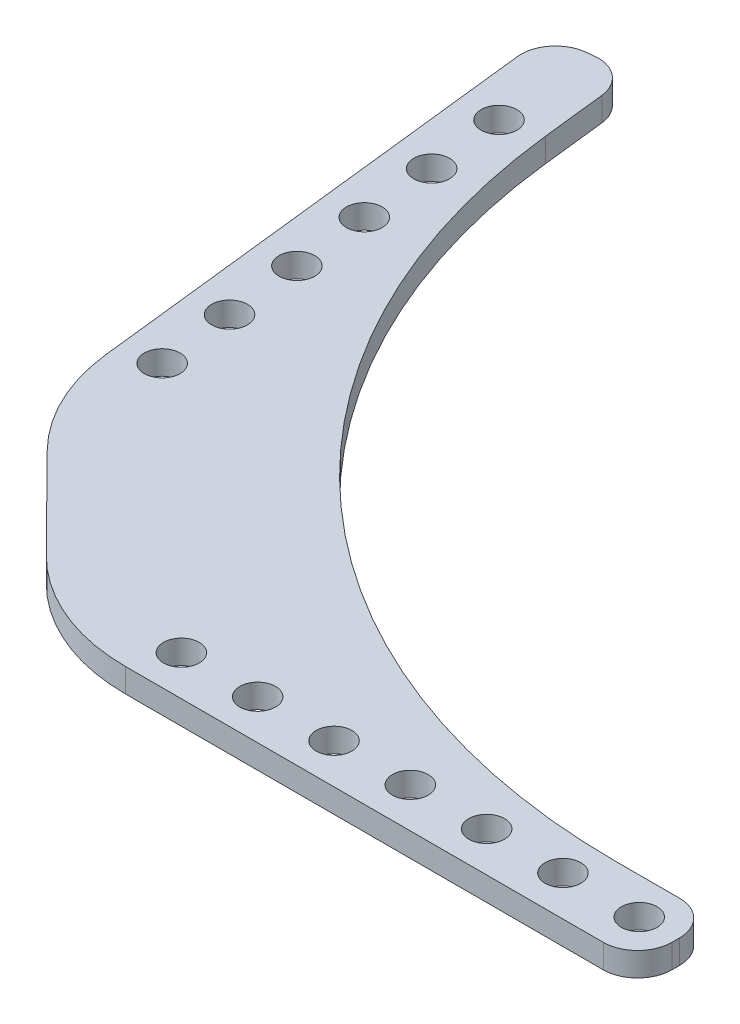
from build123d import *

# Parameters (mm, degrees)
SKETCH1_R           = 2.38125
BOSS_EXTRUDE1_DEPTH = 3.175
FILLET1_R           = 25.4


with BuildPart() as part:
    # Sketch1 → Boss-Extrude1 (new body)
    with BuildSketch(Plane(origin=(0, 0, 0), x_dir=(1, 0, 0), z_dir=(0, 1, 0))):
        with BuildLine():
            Line((0, -4.572), (0, -5.588))
            ThreePointArc((0, -5.588), (-1.339107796, -8.820892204), (-4.572, -10.16))
            Line((-4.572, -10.16), (-78.794932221, -10.16))
            Line((-78.794932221, -10.16), (-104.448932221, 15.748))
            Line((-104.448932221, 15.748), (-112.408442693, 86.264186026))
            ThreePointArc((-112.408442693, 86.264186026), (-111.434801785, 89.62293832), (-108.372228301, 91.311084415))
            Line((-108.372228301, 91.311084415), (-107.362514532, 91.423975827))
            ThreePointArc((-107.362514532, 91.423975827), (-104.002735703, 90.45388315), (-102.311355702, 87.393094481))
            Line((-102.311355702, 87.393094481), (-101.35594186, 78.928737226))
            ThreePointArc((-101.35594186, 78.928737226), (-72.248512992, 22.606503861), (-13.016913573, 0))
            Line((-13.016913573, 0), (-4.572, 0))
            ThreePointArc((-4.572, 0), (-1.339107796, -1.339107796), (0, -4.572))
        make_face()
        with Locations(Location((-106.33193916, 77.721595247, 0), (0, 0, 270))):
            Circle(SKETCH1_R, mode=Mode.SUBTRACT)
        with Locations(Location((-5.088361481, -4.849650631, 0), (0, 0, 270))):
            Circle(SKETCH1_R, mode=Mode.SUBTRACT)
        with Locations(Location((-105.203030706, 67.624508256, 0), (0, 0, 270))):
            Circle(SKETCH1_R, mode=Mode.SUBTRACT)
        with Locations(Location((-104.074122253, 57.527421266, 0), (0, 0, 270))):
            Circle(SKETCH1_R, mode=Mode.SUBTRACT)
        with Locations(Location((-102.945213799, 47.430334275, 0), (0, 0, 270))):
            Circle(SKETCH1_R, mode=Mode.SUBTRACT)
        with Locations(Location((-101.816305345, 37.333247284, 0), (0, 0, 270))):
            Circle(SKETCH1_R, mode=Mode.SUBTRACT)
        with Locations(Location((-100.687396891, 27.236160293, 0), (0, 0, 270))):
            Circle(SKETCH1_R, mode=Mode.SUBTRACT)
        with Locations(Location((-15.248361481, -4.849650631, 0), (0, 0, 270))):
            Circle(SKETCH1_R, mode=Mode.SUBTRACT)
        with Locations(Location((-25.408361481, -4.849650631, 0), (0, 0, 270))):
            Circle(SKETCH1_R, mode=Mode.SUBTRACT)
        with Locations(Location((-35.568361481, -4.849650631, 0), (0, 0, 270))):
            Circle(SKETCH1_R, mode=Mode.SUBTRACT)
        with Locations(Location((-45.728361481, -4.849650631, 0), (0, 0, 270))):
            Circle(SKETCH1_R, mode=Mode.SUBTRACT)
        with Locations(Location((-55.888361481, -4.849650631, 0), (0, 0, 270))):
            Circle(SKETCH1_R, mode=Mode.SUBTRACT)
        with Locations(Location((-66.048361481, -4.849650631, 0), (0, 0, 270))):
            Circle(SKETCH1_R, mode=Mode.SUBTRACT)
    extrude(amount=BOSS_EXTRUDE1_DEPTH)

    # Fillet1
    fillet1_edges = [part.edges().sort_by_distance(p)[0] for p in [
        (-78.794932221, 1.5875, 10.16),
        (-104.448932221, 1.5875, -15.748),
    ]]
    fillet(fillet1_edges, radius=FILLET1_R)


solid = part.part
